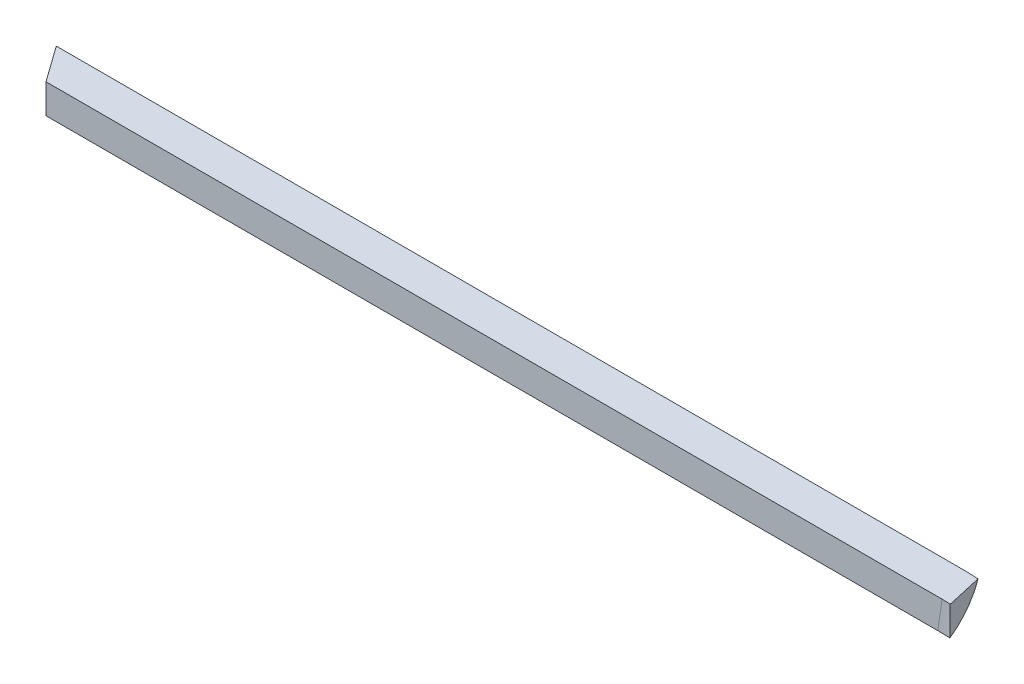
ISO-10303-21;
HEADER;
FILE_DESCRIPTION(('STEP AP214'),'2;1');
FILE_NAME('part.step','',(''),(''),'','','');
FILE_SCHEMA(('AUTOMOTIVE_DESIGN { 1 0 10303 214 1 1 1 1 }'));
ENDSEC;
DATA;
#1=APPLICATION_CONTEXT('core data for automotive mechanical design processes');
#2=APPLICATION_PROTOCOL_DEFINITION('international standard','automotive_design',2000,#1);
#3=PRODUCT_CONTEXT('',#1,'mechanical');
#4=PRODUCT('Part','Part','',(#3));
#5=PRODUCT_RELATED_PRODUCT_CATEGORY('part','',(#4));
#6=PRODUCT_DEFINITION_FORMATION('','',#4);
#7=PRODUCT_DEFINITION_CONTEXT('part definition',#1,'design');
#8=PRODUCT_DEFINITION('design','',#6,#7);
#9=PRODUCT_DEFINITION_SHAPE('','',#8);
#10=(LENGTH_UNIT() NAMED_UNIT(*) SI_UNIT(.MILLI.,.METRE.));
#11=(NAMED_UNIT(*) PLANE_ANGLE_UNIT() SI_UNIT($,.RADIAN.));
#12=(NAMED_UNIT(*) SI_UNIT($,.STERADIAN.) SOLID_ANGLE_UNIT());
#13=UNCERTAINTY_MEASURE_WITH_UNIT(LENGTH_MEASURE(1.E-05),#10,'distance_accuracy_value','');
#14=(GEOMETRIC_REPRESENTATION_CONTEXT(3) GLOBAL_UNCERTAINTY_ASSIGNED_CONTEXT((#13)) GLOBAL_UNIT_ASSIGNED_CONTEXT((#10,
#11,#12)) REPRESENTATION_CONTEXT('',''));
#15=CARTESIAN_POINT('',(0.,0.,0.));
#16=DIRECTION('',(0.,0.,1.));
#17=DIRECTION('',(1.,0.,0.));
#18=AXIS2_PLACEMENT_3D('',#15,#16,#17);
#19=CARTESIAN_POINT('',(86.5,0.,0.));
#20=DIRECTION('',(1.,0.,0.));
#21=DIRECTION('',(0.,0.,-1.));
#22=AXIS2_PLACEMENT_3D('',#19,#20,#21);
#23=PLANE('',#22);
#24=CARTESIAN_POINT('',(86.5,0.,0.));
#25=DIRECTION('',(1.,0.,0.));
#26=DIRECTION('',(0.,0.,-1.));
#27=AXIS2_PLACEMENT_3D('',#24,#25,#26);
#28=CIRCLE('',#27,85.);
#29=CARTESIAN_POINT('',(86.5,-81.8326014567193,-22.9875039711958));
#30=VERTEX_POINT('',#29);
#31=CARTESIAN_POINT('',(86.5,-81.4007699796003,-24.4727327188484));
#32=VERTEX_POINT('',#31);
#33=EDGE_CURVE('E135',#30,#32,#28,.T.);
#34=ORIENTED_EDGE('',*,*,#33,.F.);
#35=CARTESIAN_POINT('',(86.5,-83.3876780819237,-22.9717151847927));
#36=CARTESIAN_POINT('',(86.5,-83.258092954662,-22.9734548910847));
#37=CARTESIAN_POINT('',(86.5,-83.1285062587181,-22.9750749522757));
#38=CARTESIAN_POINT('',(86.5,-82.8693306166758,-22.9780964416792));
#39=CARTESIAN_POINT('',(86.5,-82.7397416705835,-22.9794978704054));
#40=CARTESIAN_POINT('',(86.5,-82.4805618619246,-22.9821027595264));
#41=CARTESIAN_POINT('',(86.5,-82.3509709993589,-22.9833062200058));
#42=CARTESIAN_POINT('',(86.5,-82.091787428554,-22.9855343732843));
#43=CARTESIAN_POINT('',(86.5,-81.9621947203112,-22.9865590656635));
#44=CARTESIAN_POINT('',(86.5,-81.8326014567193,-22.9875039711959));
#45=B_SPLINE_CURVE_WITH_KNOTS('',3,(#35,#36,#37,#38,#39,#40,#41,#42,#43,#44),.UNSPECIFIED.,.F.,
.F.,(4,2,2,2,4),(0.,0.388790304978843,0.777579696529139,1.16636892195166,1.55515906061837),.UNSPECIFIED.);
#46=CARTESIAN_POINT('',(86.5,-83.3876780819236,-22.9717151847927));
#47=VERTEX_POINT('',#46);
#48=EDGE_CURVE('E149',#47,#30,#45,.T.);
#49=ORIENTED_EDGE('',*,*,#48,.F.);
#50=CARTESIAN_POINT('',(86.5,-83.3876780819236,-22.9717151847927));
#51=CARTESIAN_POINT('',(86.5,-83.3249888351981,-23.0623396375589));
#52=CARTESIAN_POINT('',(86.5,-83.2585143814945,-23.1503434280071));
#53=CARTESIAN_POINT('',(86.5,-83.1185265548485,-23.3204927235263));
#54=CARTESIAN_POINT('',(86.5,-83.0450165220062,-23.4026409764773));
#55=CARTESIAN_POINT('',(86.5,-82.8914248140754,-23.5605531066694));
#56=CARTESIAN_POINT('',(86.5,-82.8113427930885,-23.636316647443));
#57=CARTESIAN_POINT('',(86.5,-82.6451329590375,-23.7809619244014));
#58=CARTESIAN_POINT('',(86.4999999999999,-82.5590029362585,-23.8498411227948));
#59=CARTESIAN_POINT('',(86.4999999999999,-82.3889494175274,-23.9746110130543));
#60=CARTESIAN_POINT('',(86.5,-82.3054705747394,-24.0311090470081));
#61=CARTESIAN_POINT('',(86.5,-82.1344324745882,-24.1376230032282));
#62=CARTESIAN_POINT('',(86.5,-82.0468718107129,-24.187636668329));
#63=CARTESIAN_POINT('',(86.5,-81.8679404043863,-24.2810031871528));
#64=CARTESIAN_POINT('',(86.5,-81.7765591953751,-24.3243359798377));
#65=CARTESIAN_POINT('',(86.5,-81.5907908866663,-24.4039086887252));
#66=CARTESIAN_POINT('',(86.5,-81.4964046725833,-24.4401506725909));
#67=CARTESIAN_POINT('',(86.5,-81.4007699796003,-24.4727327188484));
#68=B_SPLINE_CURVE_WITH_KNOTS('',3,(#50,#51,#52,#53,#54,#55,#56,#57,#58,#59,#60,#61,#62,#63,#64,
#65,#66,#67),.UNSPECIFIED.,.F.,.F.,(4,2,2,2,2,2,2,2,4),(0.,0.330484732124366,0.660813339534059,
0.991159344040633,1.32162667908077,1.62374215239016,1.9259625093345,2.22907339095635,
2.5320957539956),.UNSPECIFIED.);
#69=EDGE_CURVE('E171',#47,#32,#68,.T.);
#70=ORIENTED_EDGE('',*,*,#69,.T.);
#71=EDGE_LOOP('',(#34,#49,#70));
#72=FACE_BOUND('',#71,.T.);
#73=ADVANCED_FACE('F86',(#72),#23,.T.);
#74=CARTESIAN_POINT('',(38.0952752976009,-83.4050358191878,-23.));
#75=CARTESIAN_POINT('',(38.0952752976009,-83.2299307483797,-23.));
#76=CARTESIAN_POINT('',(38.0952752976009,-82.9672731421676,-23.));
#77=CARTESIAN_POINT('',(38.0952752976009,-82.6170630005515,-23.));
#78=CARTESIAN_POINT('',(38.0952752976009,-82.2668528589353,-23.));
#79=CARTESIAN_POINT('',(38.0952752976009,-82.0041952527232,-23.));
#80=CARTESIAN_POINT('',(38.0952752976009,-81.8290901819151,-23.));
#81=CARTESIAN_POINT('',(37.8896109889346,-83.1671640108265,-23.3258381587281));
#82=CARTESIAN_POINT('',(37.9073418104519,-83.0289051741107,-23.2989455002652));
#83=CARTESIAN_POINT('',(37.9336801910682,-82.8214411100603,-23.2584172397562));
#84=CARTESIAN_POINT('',(37.9682817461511,-82.5446652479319,-23.2039990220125));
#85=CARTESIAN_POINT('',(38.0025389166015,-82.2677828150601,-23.1493264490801));
#86=CARTESIAN_POINT('',(38.0278439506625,-82.0599990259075,-23.1080349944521));
#87=CARTESIAN_POINT('',(38.0445412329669,-81.9214204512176,-23.0803790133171));
#88=CARTESIAN_POINT('',(37.7041022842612,-82.8742570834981,-23.6197433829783));
#89=CARTESIAN_POINT('',(37.7398277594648,-82.7733927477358,-23.5655579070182));
#90=CARTESIAN_POINT('',(37.792896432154,-82.621943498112,-23.4838983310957));
#91=CARTESIAN_POINT('',(37.8626144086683,-82.419694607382,-23.3742521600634));
#92=CARTESIAN_POINT('',(37.9316384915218,-82.2172309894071,-23.2640934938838));
#93=CARTESIAN_POINT('',(37.9826250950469,-82.0651375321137,-23.1808961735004));
#94=CARTESIAN_POINT('',(38.0162681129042,-81.9636289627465,-23.1251726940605));
#95=CARTESIAN_POINT('',(37.5433395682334,-82.5316242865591,-23.8744430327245));
#96=CARTESIAN_POINT('',(37.5973294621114,-82.4687150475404,-23.7925555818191));
#97=CARTESIAN_POINT('',(37.6775291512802,-82.3741203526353,-23.6691480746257));
#98=CARTESIAN_POINT('',(37.7828899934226,-82.2475156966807,-23.50344600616));
#99=CARTESIAN_POINT('',(37.8872021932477,-82.1205865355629,-23.3369694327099));
#100=CARTESIAN_POINT('',(37.9642553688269,-82.0250182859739,-23.2112380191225));
#101=CARTESIAN_POINT('',(38.0150981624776,-81.9611354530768,-23.1270262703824));
#102=(BOUNDED_SURFACE() B_SPLINE_SURFACE(3,3,((#74,#75,#76,#77,#78,#79,#80),(#81,#82,#83,#84,
#85,#86,#87),(#88,#89,#90,#91,#92,#93,#94),(#95,#96,#97,#98,#99,#100,#101)),.UNSPECIFIED.,.F.,
.F.,.F.) B_SPLINE_SURFACE_WITH_KNOTS((4,4),(4,1,1,1,4),(0.,0.5),(0.,0.333333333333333,0.5,
0.666666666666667,1.),
.UNSPECIFIED.) GEOMETRIC_REPRESENTATION_ITEM() RATIONAL_B_SPLINE_SURFACE(((1.,1.,1.,1.,1.,1.,
1.),(0.985445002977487,0.985445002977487,0.985445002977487,0.985445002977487,0.985445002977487,
0.985445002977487,0.985445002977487),(0.97816750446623,0.97816750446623,0.97816750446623,
0.97816750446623,0.97816750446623,0.97816750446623,0.97816750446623),(0.97816750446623,
0.97816750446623,0.97816750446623,0.97816750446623,0.97816750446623,0.97816750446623,0.97816750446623))) REPRESENTATION_ITEM('') SURFACE());
#103=CARTESIAN_POINT('',(39.3795276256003,-79.5075707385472,-20.9653328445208));
#104=DIRECTION('',(0.845639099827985,0.,-0.533755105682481));
#105=DIRECTION('',(-0.533755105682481,0.,-0.845639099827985));
#106=AXIS2_PLACEMENT_3D('',#103,#104,#105);
#107=CIRCLE('',#106,4.58032843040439);
#108=CARTESIAN_POINT('',(38.0952752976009,-83.4050358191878,-23.));
#109=VERTEX_POINT('',#108);
#110=CARTESIAN_POINT('',(37.5433395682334,-82.531624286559,-23.8744430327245));
#111=VERTEX_POINT('',#110);
#112=EDGE_CURVE('E105',#109,#111,#107,.T.);
#113=DIRECTION('',(0.,1.,0.));
#114=VECTOR('',#113,1.);
#115=CARTESIAN_POINT('',(38.0952752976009,-75.,-23.));
#116=LINE('',#115,#114);
#117=CARTESIAN_POINT('',(38.0952752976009,-81.8290901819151,-23.));
#118=VERTEX_POINT('',#117);
#119=EDGE_CURVE('E142',#109,#118,#116,.T.);
#120=CARTESIAN_POINT('',(38.0150981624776,-81.9611354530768,-23.1270262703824));
#121=CARTESIAN_POINT('',(38.0139282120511,-81.9586419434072,-23.1288798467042));
#122=CARTESIAN_POINT('',(38.0398959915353,-81.9115200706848,-23.0877385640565));
#123=CARTESIAN_POINT('',(38.0952752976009,-81.8290901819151,-23.));
#124=CARTESIAN_POINT('',(38.0958210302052,-81.8282778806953,-22.9991353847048));
#125=CARTESIAN_POINT('',(38.0963667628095,-81.8274655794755,-22.9982707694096));
#126=CARTESIAN_POINT('',(38.0969124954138,-81.8266532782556,-22.9974061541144));
#127=(BOUNDED_CURVE() B_SPLINE_CURVE(3,(#120,#121,#122,#123,#124,#125,#126),.UNSPECIFIED.,.F.,
.F.) B_SPLINE_CURVE_WITH_KNOTS((4,3,4),(0.5,1.,1.005),
.UNSPECIFIED.) CURVE() GEOMETRIC_REPRESENTATION_ITEM() RATIONAL_B_SPLINE_CURVE((0.97816750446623,
0.97816750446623,0.985445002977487,1.,1.,1.,1.)) REPRESENTATION_ITEM(''));
#128=CARTESIAN_POINT('',(38.0150981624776,-81.9611354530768,-23.1270262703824));
#129=VERTEX_POINT('',#128);
#130=EDGE_CURVE('E271',#129,#118,#127,.T.);
#131=CARTESIAN_POINT('',(37.5433395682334,-82.5316242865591,-23.8744430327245));
#132=CARTESIAN_POINT('',(37.5973294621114,-82.4687150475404,-23.7925555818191));
#133=CARTESIAN_POINT('',(37.6775291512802,-82.3741203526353,-23.6691480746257));
#134=CARTESIAN_POINT('',(37.7828899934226,-82.2475156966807,-23.50344600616));
#135=CARTESIAN_POINT('',(37.8872021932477,-82.1205865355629,-23.3369694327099));
#136=CARTESIAN_POINT('',(37.9642553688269,-82.0250182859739,-23.2112380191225));
#137=CARTESIAN_POINT('',(38.0150981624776,-81.9611354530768,-23.1270262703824));
#138=(BOUNDED_CURVE() B_SPLINE_CURVE(3,(#131,#132,#133,#134,#135,#136,#137),.UNSPECIFIED.,.F.,
.F.) B_SPLINE_CURVE_WITH_KNOTS((4,1,1,1,4),(0.,0.333333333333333,0.5,0.666666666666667,1.),
.UNSPECIFIED.) CURVE() GEOMETRIC_REPRESENTATION_ITEM() RATIONAL_B_SPLINE_CURVE((0.97816750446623,
0.97816750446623,0.97816750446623,0.97816750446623,0.97816750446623,0.97816750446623,0.97816750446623)) REPRESENTATION_ITEM(''));
#139=EDGE_CURVE('E158',#111,#129,#138,.T.);
#140=ORIENTED_EDGE('',*,*,#112,.F.);
#141=ORIENTED_EDGE('',*,*,#119,.T.);
#142=ORIENTED_EDGE('',*,*,#130,.F.);
#143=ORIENTED_EDGE('',*,*,#139,.F.);
#144=EDGE_LOOP('',(#140,#141,#142,#143));
#145=FACE_BOUND('',#144,.T.);
#146=ADVANCED_FACE('F156',(#145),#102,.F.);
#147=CARTESIAN_POINT('',(37.5433395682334,-82.5316242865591,-23.8744430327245));
#148=CARTESIAN_POINT('',(37.5973294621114,-82.4687150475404,-23.7925555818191));
#149=CARTESIAN_POINT('',(37.6775291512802,-82.3741203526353,-23.6691480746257));
#150=CARTESIAN_POINT('',(37.7828899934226,-82.2475156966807,-23.50344600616));
#151=CARTESIAN_POINT('',(37.8872021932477,-82.1205865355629,-23.3369694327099));
#152=CARTESIAN_POINT('',(37.9642553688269,-82.0250182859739,-23.2112380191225));
#153=CARTESIAN_POINT('',(38.0150981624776,-81.9611354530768,-23.1270262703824));
#154=CARTESIAN_POINT('',(37.3825768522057,-82.18899148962,-24.1291426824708));
#155=CARTESIAN_POINT('',(37.4548311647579,-82.164037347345,-24.0195532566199));
#156=CARTESIAN_POINT('',(37.5621618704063,-82.1262972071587,-23.8543978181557));
#157=CARTESIAN_POINT('',(37.7031655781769,-82.0753367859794,-23.6326398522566));
#158=CARTESIAN_POINT('',(37.8427658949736,-82.0239420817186,-23.4098453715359));
#159=CARTESIAN_POINT('',(37.945885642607,-81.9848990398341,-23.2415798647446));
#160=CARTESIAN_POINT('',(38.0139282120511,-81.9586419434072,-23.1288798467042));
#161=CARTESIAN_POINT('',(37.2513090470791,-81.8067541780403,-24.3371129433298));
#162=CARTESIAN_POINT('',(37.3415580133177,-81.8191945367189,-24.2002306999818));
#163=CARTESIAN_POINT('',(37.4756190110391,-81.8374692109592,-23.993943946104));
#164=CARTESIAN_POINT('',(37.651739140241,-81.8610357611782,-23.7169580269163));
#165=CARTESIAN_POINT('',(37.8261063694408,-81.8840598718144,-23.4386774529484));
#166=CARTESIAN_POINT('',(37.9549076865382,-81.900707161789,-23.2285060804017));
#167=CARTESIAN_POINT('',(38.0398959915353,-81.9115200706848,-23.0877385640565));
#168=CARTESIAN_POINT('',(37.1517581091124,-81.3941222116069,-24.4948335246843));
#169=CARTESIAN_POINT('',(37.2597378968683,-81.4434088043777,-24.3310586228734));
#170=CARTESIAN_POINT('',(37.420137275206,-81.5168770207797,-24.0842436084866));
#171=CARTESIAN_POINT('',(37.6308589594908,-81.6138778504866,-23.7528394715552));
#172=CARTESIAN_POINT('',(37.839483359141,-81.7102296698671,-23.4198863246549));
#173=CARTESIAN_POINT('',(37.9935897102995,-81.7817507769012,-23.1684234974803));
#174=CARTESIAN_POINT('',(38.0952752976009,-81.8290901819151,-23.));
#175=CARTESIAN_POINT('',(37.1507770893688,-81.390055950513,-24.4963877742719));
#176=CARTESIAN_POINT('',(37.2589316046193,-81.4397056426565,-24.332347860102));
#177=CARTESIAN_POINT('',(37.4195905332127,-81.5137177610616,-24.0851334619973));
#178=CARTESIAN_POINT('',(37.630653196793,-81.6114422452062,-23.7531930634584));
#179=CARTESIAN_POINT('',(37.8396151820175,-81.7085166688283,-23.4197011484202));
#180=CARTESIAN_POINT('',(37.9939709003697,-81.7805785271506,-23.1678314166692));
#181=CARTESIAN_POINT('',(38.0958210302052,-81.8282778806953,-22.9991353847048));
#182=CARTESIAN_POINT('',(37.1497960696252,-81.3859896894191,-24.4979420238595));
#183=CARTESIAN_POINT('',(37.2581253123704,-81.4360024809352,-24.3336370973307));
#184=CARTESIAN_POINT('',(37.4190437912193,-81.5105585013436,-24.086023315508));
#185=CARTESIAN_POINT('',(37.6304474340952,-81.6090066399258,-23.7535466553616));
#186=CARTESIAN_POINT('',(37.8397470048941,-81.7068036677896,-23.4195159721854));
#187=CARTESIAN_POINT('',(37.9943520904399,-81.7794062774,-23.1672393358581));
#188=CARTESIAN_POINT('',(38.0963667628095,-81.8274655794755,-22.9982707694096));
#189=CARTESIAN_POINT('',(37.1488150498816,-81.3819234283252,-24.4994962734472));
#190=CARTESIAN_POINT('',(37.2573190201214,-81.432299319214,-24.3349263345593));
#191=CARTESIAN_POINT('',(37.418497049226,-81.5073992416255,-24.0869131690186));
#192=CARTESIAN_POINT('',(37.6302416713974,-81.6065710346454,-23.7539002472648));
#193=CARTESIAN_POINT('',(37.8398788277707,-81.7050906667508,-23.4193307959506));
#194=CARTESIAN_POINT('',(37.9947332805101,-81.7782340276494,-23.1666472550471));
#195=CARTESIAN_POINT('',(38.0969124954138,-81.8266532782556,-22.9974061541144));
#196=(BOUNDED_SURFACE() B_SPLINE_SURFACE(3,3,((#147,#148,#149,#150,#151,#152,#153),(#154,#155,
#156,#157,#158,#159,#160),(#161,#162,#163,#164,#165,#166,#167),(#168,#169,#170,#171,#172,#173,
#174),(#175,#176,#177,#178,#179,#180,#181),(#182,#183,#184,#185,#186,#187,#188),(#189,#190,#191,
#192,#193,#194,#195)),.UNSPECIFIED.,.F.,.F.,.F.) B_SPLINE_SURFACE_WITH_KNOTS((4,3,4),(4,1,1,1,
4),(0.5,1.,1.005),(0.,0.333333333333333,0.5,0.666666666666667,1.),
.UNSPECIFIED.) GEOMETRIC_REPRESENTATION_ITEM() RATIONAL_B_SPLINE_SURFACE(((0.97816750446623,
0.97816750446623,0.97816750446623,0.97816750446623,0.97816750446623,0.97816750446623,
0.97816750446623),(0.97816750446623,0.97816750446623,0.97816750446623,0.97816750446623,
0.97816750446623,0.97816750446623,0.97816750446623),(0.985445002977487,0.985445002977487,
0.985445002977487,0.985445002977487,0.985445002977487,0.985445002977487,0.985445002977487),(1.,
1.,1.,1.,1.,1.,1.),(1.,1.,1.,1.,1.,1.,1.),(1.,1.,1.,1.,1.,1.,1.),(1.,1.,1.,1.,1.,1.,1.))) REPRESENTATION_ITEM('') SURFACE());
#197=CARTESIAN_POINT('',(39.3795276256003,-79.5075707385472,-20.9653328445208));
#198=DIRECTION('',(0.845639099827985,0.,-0.533755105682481));
#199=DIRECTION('',(-0.533755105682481,0.,-0.845639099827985));
#200=AXIS2_PLACEMENT_3D('',#197,#198,#199);
#201=CIRCLE('',#200,4.58032843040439);
#202=CARTESIAN_POINT('',(37.1517581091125,-81.394122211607,-24.4948335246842));
#203=VERTEX_POINT('',#202);
#204=EDGE_CURVE('E161',#111,#203,#201,.T.);
#205=CARTESIAN_POINT('',(38.0952752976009,-81.8290901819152,-23.));
#206=CARTESIAN_POINT('',(37.9806490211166,-81.7757263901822,-23.1898574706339));
#207=CARTESIAN_POINT('',(37.8646594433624,-81.7219163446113,-23.3787651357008));
#208=CARTESIAN_POINT('',(37.6499158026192,-81.6226603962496,-23.7227248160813));
#209=CARTESIAN_POINT('',(37.5515809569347,-81.5773464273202,-23.8780767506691));
#210=CARTESIAN_POINT('',(37.3530544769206,-81.486151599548,-24.1874577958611));
#211=CARTESIAN_POINT('',(37.2528625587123,-81.4402706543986,-24.341486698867));
#212=CARTESIAN_POINT('',(37.1517581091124,-81.3941222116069,-24.4948335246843));
#213=B_SPLINE_CURVE_WITH_KNOTS('',3,(#205,#206,#207,#208,#209,#210,#211,#212),.UNSPECIFIED.,.F.,
.F.,(4,2,2,4),(0.,0.684311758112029,1.25237823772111,1.82053228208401),.UNSPECIFIED.);
#214=EDGE_CURVE('E178',#118,#203,#213,.T.);
#215=ORIENTED_EDGE('',*,*,#204,.F.);
#216=ORIENTED_EDGE('',*,*,#139,.T.);
#217=ORIENTED_EDGE('',*,*,#130,.T.);
#218=ORIENTED_EDGE('',*,*,#214,.T.);
#219=EDGE_LOOP('',(#215,#216,#217,#218));
#220=FACE_BOUND('',#219,.T.);
#221=ADVANCED_FACE('F238',(#220),#196,.F.);
#222=CARTESIAN_POINT('',(34.5,-75.,-23.));
#223=DIRECTION('',(0.,0.,1.));
#224=DIRECTION('',(1.,0.,0.));
#225=AXIS2_PLACEMENT_3D('',#222,#223,#224);
#226=PLANE('',#225);
#227=CARTESIAN_POINT('',(34.5,-75.,-23.));
#228=DIRECTION('',(0.,0.,1.));
#229=DIRECTION('',(1.,0.,0.));
#230=AXIS2_PLACEMENT_3D('',#227,#228,#229);
#231=CIRCLE('',#230,52.);
#232=CARTESIAN_POINT('',(86.0496219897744,-81.8290901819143,-23.));
#233=VERTEX_POINT('',#232);
#234=CARTESIAN_POINT('',(85.8162291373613,-83.4050358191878,-23.));
#235=VERTEX_POINT('',#234);
#236=EDGE_CURVE('E150',#233,#235,#231,.F.);
#237=ORIENTED_EDGE('',*,*,#236,.F.);
#238=DIRECTION('',(1.,0.,0.));
#239=VECTOR('',#238,1.);
#240=CARTESIAN_POINT('',(-25.5,-81.8290901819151,-23.));
#241=LINE('',#240,#239);
#242=EDGE_CURVE('E147',#118,#233,#241,.T.);
#243=ORIENTED_EDGE('',*,*,#242,.F.);
#244=ORIENTED_EDGE('',*,*,#119,.F.);
#245=DIRECTION('',(1.,0.,0.));
#246=VECTOR('',#245,1.);
#247=CARTESIAN_POINT('',(34.5,-83.4050358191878,-23.));
#248=LINE('',#247,#246);
#249=EDGE_CURVE('E145',#235,#109,#248,.F.);
#250=ORIENTED_EDGE('',*,*,#249,.F.);
#251=EDGE_LOOP('',(#237,#243,#244,#250));
#252=FACE_BOUND('',#251,.T.);
#253=ADVANCED_FACE('F144',(#252),#226,.T.);
#254=CARTESIAN_POINT('',(34.5,-75.,-15.));
#255=DIRECTION('',(0.,0.,1.));
#256=DIRECTION('',(1.,0.,0.));
#257=AXIS2_PLACEMENT_3D('',#254,#255,#256);
#258=TOROIDAL_SURFACE('',#257,52.,8.);
#259=ORIENTED_EDGE('',*,*,#48,.T.);
#260=CARTESIAN_POINT('',(86.5002,-81.832604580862,-22.9874928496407));
#261=CARTESIAN_POINT('',(86.2728742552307,-81.8290366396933,-23.0001669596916));
#262=CARTESIAN_POINT('',(86.0449935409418,-81.8281936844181,-23.0031830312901));
#263=CARTESIAN_POINT('',(85.5898872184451,-81.8318461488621,-22.9902008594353));
#264=CARTESIAN_POINT('',(85.3626614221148,-81.8363398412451,-22.9742087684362));
#265=CARTESIAN_POINT('',(84.9111550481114,-81.8505306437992,-22.923595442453));
#266=CARTESIAN_POINT('',(84.686867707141,-81.8602121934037,-22.8890299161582));
#267=CARTESIAN_POINT('',(84.2421112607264,-81.8845546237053,-22.801793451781));
#268=CARTESIAN_POINT('',(84.0216423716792,-81.8992157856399,-22.7491214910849));
#269=CARTESIAN_POINT('',(83.5862508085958,-81.9332215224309,-22.6263397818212));
#270=CARTESIAN_POINT('',(83.3713224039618,-81.9525610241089,-22.5562489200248));
#271=CARTESIAN_POINT('',(82.9480591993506,-81.9956040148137,-22.3992755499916));
#272=CARTESIAN_POINT('',(82.7397268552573,-82.019309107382,-22.3123868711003));
#273=CARTESIAN_POINT('',(82.3309512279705,-82.0707083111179,-22.1225789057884));
#274=CARTESIAN_POINT('',(82.1305094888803,-82.0984031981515,-22.0196565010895));
#275=CARTESIAN_POINT('',(81.7386983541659,-82.1573685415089,-21.7986210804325));
#276=CARTESIAN_POINT('',(81.5473324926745,-82.1886403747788,-21.680502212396));
#277=CARTESIAN_POINT('',(80.9729457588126,-82.2899317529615,-21.2941298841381));
#278=CARTESIAN_POINT('',(80.6066968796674,-82.3652518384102,-21.0017657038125));
#279=CARTESIAN_POINT('',(79.9273579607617,-82.5255416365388,-20.3627870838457));
#280=CARTESIAN_POINT('',(79.614287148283,-82.6105148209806,-20.0161531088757));
#281=CARTESIAN_POINT('',(79.1847390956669,-82.7439324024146,-19.4545877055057));
#282=CARTESIAN_POINT('',(79.0458583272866,-82.7904066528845,-19.2559737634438));
#283=CARTESIAN_POINT('',(78.7857943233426,-82.8842986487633,-18.8477271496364));
#284=CARTESIAN_POINT('',(78.6646045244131,-82.9317160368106,-18.6380986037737));
#285=CARTESIAN_POINT('',(78.4409824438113,-83.0269348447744,-18.2092377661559));
#286=CARTESIAN_POINT('',(78.3385448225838,-83.0747361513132,-17.9900082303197));
#287=CARTESIAN_POINT('',(78.1534152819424,-83.1701864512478,-17.5434367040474));
#288=CARTESIAN_POINT('',(78.0707140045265,-83.2178355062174,-17.3160986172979));
#289=CARTESIAN_POINT('',(77.9338550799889,-83.3073156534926,-16.8800223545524));
#290=CARTESIAN_POINT('',(77.877566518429,-83.3492138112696,-16.6719643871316));
#291=CARTESIAN_POINT('',(77.7819687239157,-83.4321497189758,-16.251838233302));
#292=CARTESIAN_POINT('',(77.7426567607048,-83.4731876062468,-16.0397706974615));
#293=CARTESIAN_POINT('',(77.6814852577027,-83.5541550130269,-15.612509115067));
#294=CARTESIAN_POINT('',(77.6596574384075,-83.5940823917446,-15.397310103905));
#295=CARTESIAN_POINT('',(77.6339698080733,-83.6724728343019,-14.9654879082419));
#296=CARTESIAN_POINT('',(77.6301175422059,-83.7109352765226,-14.7488641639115));
#297=CARTESIAN_POINT('',(77.6354608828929,-83.7485090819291,-14.5322822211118));
#298=B_SPLINE_CURVE_WITH_KNOTS('',3,(#260,#261,#262,#263,#264,#265,#266,#267,#268,#269,#270,
#271,#272,#273,#274,#275,#276,#277,#278,#279,#280,#281,#282,#283,#284,#285,#286,#287,#288,#289,
#290,#291,#292,#293,#294,#295,#296,#297),.UNSPECIFIED.,.F.,.F.,(4,2,2,2,2,2,2,2,2,2,2,2,2,2,2,2,
2,2,4),(0.,0.682863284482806,1.36550560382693,2.04611175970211,2.72675636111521,
3.40666615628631,4.0868261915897,4.76711867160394,5.44767391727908,6.86491441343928,
8.28266624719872,9.02222900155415,9.76151667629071,10.5005935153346,11.2393192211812,
11.8973667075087,12.5553083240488,13.2144409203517,13.8738501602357),.UNSPECIFIED.);
#299=EDGE_CURVE('E220',#30,#233,#298,.T.);
#300=ORIENTED_EDGE('',*,*,#299,.T.);
#301=ORIENTED_EDGE('',*,*,#236,.T.);
#302=CARTESIAN_POINT('',(86.5,-83.3876780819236,-22.9717151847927));
#303=CARTESIAN_POINT('',(86.4208117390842,-83.3883996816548,-22.9782976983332));
#304=CARTESIAN_POINT('',(86.3415326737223,-83.3895727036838,-22.9837251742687));
#305=CARTESIAN_POINT('',(86.1879539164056,-83.3927145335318,-22.9920085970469));
#306=CARTESIAN_POINT('',(86.1136607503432,-83.3946275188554,-22.9950070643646));
#307=CARTESIAN_POINT('',(85.9649825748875,-83.3992410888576,-22.9990039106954));
#308=CARTESIAN_POINT('',(85.8905975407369,-83.4019423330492,-23.0000006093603));
#309=CARTESIAN_POINT('',(85.8162291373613,-83.4050358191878,-23.));
#310=B_SPLINE_CURVE_WITH_KNOTS('',3,(#302,#303,#304,#305,#306,#307,#308,#309),.UNSPECIFIED.,.F.,
.F.,(4,2,2,4),(0.,0.238382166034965,0.461485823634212,0.684776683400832),.UNSPECIFIED.);
#311=EDGE_CURVE('E154',#47,#235,#310,.T.);
#312=ORIENTED_EDGE('',*,*,#311,.F.);
#313=EDGE_LOOP('',(#259,#300,#301,#312));
#314=FACE_BOUND('',#313,.T.);
#315=ADVANCED_FACE('F210',(#314),#258,.F.);
#316=CARTESIAN_POINT('',(-78.5,0.,0.));
#317=DIRECTION('',(1.,0.,0.));
#318=DIRECTION('',(0.,0.,-1.));
#319=AXIS2_PLACEMENT_3D('',#316,#317,#318);
#320=CYLINDRICAL_SURFACE('',#319,85.);
#321=ORIENTED_EDGE('',*,*,#214,.F.);
#322=ORIENTED_EDGE('',*,*,#242,.T.);
#323=ORIENTED_EDGE('',*,*,#299,.F.);
#324=ORIENTED_EDGE('',*,*,#33,.T.);
#325=CARTESIAN_POINT('',(86.5,-81.4007699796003,-24.4727327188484));
#326=CARTESIAN_POINT('',(86.4603343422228,-81.4001548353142,-24.4747788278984));
#327=CARTESIAN_POINT('',(86.4206681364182,-81.3995391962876,-24.476826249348));
#328=CARTESIAN_POINT('',(86.3413239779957,-81.3983511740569,-24.48077674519));
#329=CARTESIAN_POINT('',(86.3016460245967,-81.3977787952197,-24.4826798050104));
#330=CARTESIAN_POINT('',(86.2248508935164,-81.3967559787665,-24.4860801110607));
#331=CARTESIAN_POINT('',(86.1877346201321,-81.3963000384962,-24.487595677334));
#332=CARTESIAN_POINT('',(86.1134893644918,-81.3954964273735,-24.4902667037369));
#333=CARTESIAN_POINT('',(86.0763603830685,-81.3951487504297,-24.4914221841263));
#334=CARTESIAN_POINT('',(86.002069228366,-81.394610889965,-24.4932096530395));
#335=CARTESIAN_POINT('',(85.9649070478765,-81.3944207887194,-24.4938413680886));
#336=CARTESIAN_POINT('',(85.8905724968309,-81.3941757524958,-24.4946556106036));
#337=CARTESIAN_POINT('',(85.8534001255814,-81.3941208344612,-24.4948380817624));
#338=CARTESIAN_POINT('',(85.8162291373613,-81.3941222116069,-24.4948335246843));
#339=B_SPLINE_CURVE_WITH_KNOTS('',3,(#325,#326,#327,#328,#329,#330,#331,#332,#333,#334,#335,
#336,#337,#338),.UNSPECIFIED.,.F.,.F.,(4,2,2,2,2,2,4),(0.,0.119170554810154,0.238353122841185,
0.349801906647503,0.4612444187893,0.572745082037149,0.684259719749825),.UNSPECIFIED.);
#340=CARTESIAN_POINT('',(85.8162291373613,-81.3941222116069,-24.4948335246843));
#341=VERTEX_POINT('',#340);
#342=EDGE_CURVE('E96',#32,#341,#339,.T.);
#343=ORIENTED_EDGE('',*,*,#342,.T.);
#344=DIRECTION('',(1.,0.,0.));
#345=VECTOR('',#344,1.);
#346=CARTESIAN_POINT('',(-78.5,-81.3941222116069,-24.4948335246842));
#347=LINE('',#346,#345);
#348=EDGE_CURVE('E12',#341,#203,#347,.F.);
#349=ORIENTED_EDGE('',*,*,#348,.T.);
#350=EDGE_LOOP('',(#321,#322,#323,#324,#343,#349));
#351=FACE_BOUND('',#350,.T.);
#352=ADVANCED_FACE('F186',(#351),#320,.F.);
#353=CARTESIAN_POINT('',(86.5,-83.3876780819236,-22.9717151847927));
#354=CARTESIAN_POINT('',(86.4747265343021,-83.3879351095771,-22.9737474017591));
#355=CARTESIAN_POINT('',(86.4241796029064,-83.388449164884,-22.9778118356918));
#356=CARTESIAN_POINT('',(86.3482784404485,-83.3895699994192,-22.9830158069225));
#357=CARTESIAN_POINT('',(86.2723323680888,-83.3909463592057,-22.9875676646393));
#358=CARTESIAN_POINT('',(86.1963459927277,-83.3926029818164,-22.9914043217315));
#359=CARTESIAN_POINT('',(86.1203322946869,-83.3945327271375,-22.994544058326));
#360=CARTESIAN_POINT('',(86.0493706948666,-83.3965900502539,-22.9968207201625));
#361=CARTESIAN_POINT('',(85.9936116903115,-83.3983871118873,-22.9981487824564));
#362=CARTESIAN_POINT('',(85.9530608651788,-83.3997815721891,-22.9988914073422));
#363=CARTESIAN_POINT('',(85.9201147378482,-83.4009619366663,-22.9993739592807));
#364=CARTESIAN_POINT('',(85.8897052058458,-83.4021006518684,-22.9996940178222));
#365=CARTESIAN_POINT('',(85.8656333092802,-83.403036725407,-22.9998591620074));
#366=CARTESIAN_POINT('',(85.8504309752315,-83.403640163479,-22.9999322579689));
#367=CARTESIAN_POINT('',(85.8390297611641,-83.4040989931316,-22.9999711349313));
#368=CARTESIAN_POINT('',(85.8276290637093,-83.4045635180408,-22.9999954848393));
#369=CARTESIAN_POINT('',(85.8200291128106,-83.4048783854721,-22.9999984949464));
#370=CARTESIAN_POINT('',(85.8162291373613,-83.4050358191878,-23.));
#371=CARTESIAN_POINT('',(86.4999999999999,-82.8990033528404,-23.6779938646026));
#372=CARTESIAN_POINT('',(86.4754982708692,-82.898558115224,-23.6799040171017));
#373=CARTESIAN_POINT('',(86.4265171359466,-82.8976676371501,-23.683724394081));
#374=CARTESIAN_POINT('',(86.3524078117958,-82.8966314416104,-23.688755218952));
#375=CARTESIAN_POINT('',(86.2769892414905,-82.8958983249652,-23.6931417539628));
#376=CARTESIAN_POINT('',(86.1994339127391,-82.8955511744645,-23.6967366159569));
#377=CARTESIAN_POINT('',(86.1188476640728,-82.8956516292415,-23.6994463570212));
#378=CARTESIAN_POINT('',(86.0399907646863,-82.8962259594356,-23.7010484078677));
#379=CARTESIAN_POINT('',(85.9749647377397,-82.8970604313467,-23.7015827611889));
#380=CARTESIAN_POINT('',(85.9260694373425,-82.8978699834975,-23.7015933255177));
#381=CARTESIAN_POINT('',(85.8854732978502,-82.8986421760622,-23.7013894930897));
#382=CARTESIAN_POINT('',(85.8473113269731,-82.8994719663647,-23.7009951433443));
#383=CARTESIAN_POINT('',(85.8160069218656,-82.9002155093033,-23.7005308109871));
#384=CARTESIAN_POINT('',(85.7963957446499,-82.9007165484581,-23.7001827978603));
#385=CARTESIAN_POINT('',(85.7819883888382,-82.9011083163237,-23.6998939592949));
#386=CARTESIAN_POINT('',(85.7668663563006,-82.9015157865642,-23.6995783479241));
#387=CARTESIAN_POINT('',(85.7565858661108,-82.901799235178,-23.699346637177));
#388=CARTESIAN_POINT('',(85.7514309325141,-82.9019428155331,-23.6992284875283));
#389=CARTESIAN_POINT('',(86.4999999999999,-82.2137172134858,-24.195695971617));
#390=CARTESIAN_POINT('',(86.4756075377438,-82.2130296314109,-24.1973703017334));
#391=CARTESIAN_POINT('',(86.4268450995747,-82.2116544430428,-24.2007190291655));
#392=CARTESIAN_POINT('',(86.3530620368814,-82.2097915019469,-24.2052987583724));
#393=CARTESIAN_POINT('',(86.2779264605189,-82.2081803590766,-24.2093692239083));
#394=CARTESIAN_POINT('',(86.2005789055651,-82.2069127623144,-24.2127629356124));
#395=CARTESIAN_POINT('',(86.1200895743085,-82.2060699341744,-24.2153392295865));
#396=CARTESIAN_POINT('',(86.0411884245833,-82.2057582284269,-24.2168426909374));
#397=CARTESIAN_POINT('',(85.9760074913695,-82.2059041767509,-24.2172902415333));
#398=CARTESIAN_POINT('',(85.9269381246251,-82.2062211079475,-24.2172227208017));
#399=CARTESIAN_POINT('',(85.8861510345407,-82.2065987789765,-24.216944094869));
#400=CARTESIAN_POINT('',(85.8479848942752,-82.2070650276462,-24.216487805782));
#401=CARTESIAN_POINT('',(85.8161829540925,-82.2075224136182,-24.2159764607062));
#402=CARTESIAN_POINT('',(85.7966066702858,-82.2078433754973,-24.2155994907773));
#403=CARTESIAN_POINT('',(85.782614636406,-82.208100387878,-24.2152894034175));
#404=CARTESIAN_POINT('',(85.7672829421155,-82.2083735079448,-24.2149528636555));
#405=CARTESIAN_POINT('',(85.7567252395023,-82.2085674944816,-24.21470764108));
#406=CARTESIAN_POINT('',(85.7514309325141,-82.2086665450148,-24.2145826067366));
#407=CARTESIAN_POINT('',(86.5,-81.4007699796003,-24.4727327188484));
#408=CARTESIAN_POINT('',(86.4747239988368,-81.4003776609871,-24.4740371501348));
#409=CARTESIAN_POINT('',(86.4241719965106,-81.3995930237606,-24.4766460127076));
#410=CARTESIAN_POINT('',(86.3483284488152,-81.3984496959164,-24.4804474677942));
#411=CARTESIAN_POINT('',(86.2724537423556,-81.3973736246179,-24.4840252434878));
#412=CARTESIAN_POINT('',(86.1965325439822,-81.3963984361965,-24.4872675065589));
#413=CARTESIAN_POINT('',(86.1205484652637,-81.395557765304,-24.4900623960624));
#414=CARTESIAN_POINT('',(86.0495596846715,-81.394930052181,-24.4921491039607));
#415=CARTESIAN_POINT('',(85.9937151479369,-81.3945700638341,-24.4933456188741));
#416=CARTESIAN_POINT('',(85.9530792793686,-81.3943813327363,-24.4939727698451));
#417=CARTESIAN_POINT('',(85.9200067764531,-81.3942702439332,-24.494341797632));
#418=CARTESIAN_POINT('',(85.8900961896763,-81.3941942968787,-24.4945940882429));
#419=CARTESIAN_POINT('',(85.8650101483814,-81.394155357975,-24.4947234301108));
#420=CARTESIAN_POINT('',(85.8502411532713,-81.3941381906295,-24.4947804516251));
#421=CARTESIAN_POINT('',(85.8403457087,-81.3941290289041,-24.4948108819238));
#422=CARTESIAN_POINT('',(85.8285893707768,-81.3941232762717,-24.4948299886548));
#423=CARTESIAN_POINT('',(85.8203492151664,-81.3941225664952,-24.4948323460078));
#424=CARTESIAN_POINT('',(85.8162291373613,-81.3941222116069,-24.4948335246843));
#425=(BOUNDED_SURFACE() B_SPLINE_SURFACE(3,3,((#353,#354,#355,#356,#357,#358,#359,#360,#361,
#362,#363,#364,#365,#366,#367,#368,#369,#370),(#371,#372,#373,#374,#375,#376,#377,#378,#379,
#380,#381,#382,#383,#384,#385,#386,#387,#388),(#389,#390,#391,#392,#393,#394,#395,#396,#397,
#398,#399,#400,#401,#402,#403,#404,#405,#406),(#407,#408,#409,#410,#411,#412,#413,#414,#415,
#416,#417,#418,#419,#420,#421,#422,#423,#424)),.UNSPECIFIED.,.F.,.F.,
.F.) B_SPLINE_SURFACE_WITH_KNOTS((4,4),(4,1,1,1,1,1,1,1,1,1,1,1,1,1,1,4),(0.,1.),(0.,
0.0555555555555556,0.111111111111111,0.166666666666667,0.222222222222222,0.277777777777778,
0.333333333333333,0.377777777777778,0.4,0.422222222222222,0.45,0.466666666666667,0.475,
0.483333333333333,0.491666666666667,0.5),
.UNSPECIFIED.) GEOMETRIC_REPRESENTATION_ITEM() RATIONAL_B_SPLINE_SURFACE(((1.,1.,1.,1.,1.,1.,1.,
1.,1.,1.,1.,1.,1.,1.,1.,1.,1.,1.),(0.966461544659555,0.966461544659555,0.966444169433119,
0.966386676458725,0.966318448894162,0.966260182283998,0.966232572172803,0.966254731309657,
0.966319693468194,0.966395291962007,0.966473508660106,0.966564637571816,0.966651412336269,
0.966711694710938,0.966759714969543,0.966810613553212,0.966846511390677,0.966864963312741),
(0.966461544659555,0.966461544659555,0.966444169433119,0.966386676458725,0.966318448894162,
0.966260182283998,0.966232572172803,0.966254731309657,0.966319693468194,0.966395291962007,
0.966473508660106,0.966564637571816,0.966651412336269,0.966711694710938,0.966759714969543,
0.966810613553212,0.966846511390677,0.966864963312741),(1.,1.,1.,1.,1.,1.,1.,1.,1.,1.,1.,1.,1.,
1.,1.,1.,1.,1.))) REPRESENTATION_ITEM('') SURFACE());
#426=CARTESIAN_POINT('',(86.7375269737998,-80.1854788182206,-20.7689150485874));
#427=DIRECTION('',(0.970542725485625,-0.143734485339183,-0.193357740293));
#428=DIRECTION('',(-0.195386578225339,0.,-0.980726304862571));
#429=AXIS2_PLACEMENT_3D('',#426,#427,#428);
#430=CIRCLE('',#429,4.0239380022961);
#431=EDGE_CURVE('E153',#235,#341,#430,.T.);
#432=ORIENTED_EDGE('',*,*,#69,.F.);
#433=ORIENTED_EDGE('',*,*,#311,.T.);
#434=ORIENTED_EDGE('',*,*,#431,.T.);
#435=ORIENTED_EDGE('',*,*,#342,.F.);
#436=EDGE_LOOP('',(#432,#433,#434,#435));
#437=FACE_BOUND('',#436,.T.);
#438=ADVANCED_FACE('F180',(#437),#425,.F.);
#439=CARTESIAN_POINT('',(85.8162291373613,-83.4050358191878,-23.));
#440=CARTESIAN_POINT('',(85.6571592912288,-83.4050358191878,-23.));
#441=CARTESIAN_POINT('',(85.126926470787,-83.4050358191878,-23.));
#442=CARTESIAN_POINT('',(84.3315772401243,-83.4050358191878,-23.));
#443=CARTESIAN_POINT('',(83.4301814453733,-83.4050358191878,-23.));
#444=CARTESIAN_POINT('',(82.3697158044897,-83.4050358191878,-23.));
#445=CARTESIAN_POINT('',(80.7790173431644,-83.4050358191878,-23.));
#446=CARTESIAN_POINT('',(78.6580860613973,-83.4050358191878,-23.));
#447=CARTESIAN_POINT('',(76.3604105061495,-83.4050358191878,-23.));
#448=CARTESIAN_POINT('',(73.4441299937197,-83.4050358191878,-23.));
#449=CARTESIAN_POINT('',(69.5557559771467,-83.4050358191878,-23.));
#450=CARTESIAN_POINT('',(64.60691631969,-83.4050358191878,-23.));
#451=CARTESIAN_POINT('',(59.3045881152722,-83.4050358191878,-23.));
#452=CARTESIAN_POINT('',(54.0022599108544,-83.4050358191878,-23.));
#453=CARTESIAN_POINT('',(48.6999317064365,-83.4050358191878,-23.));
#454=CARTESIAN_POINT('',(43.3976035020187,-83.4050358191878,-23.));
#455=CARTESIAN_POINT('',(39.8627180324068,-83.4050358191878,-23.));
#456=CARTESIAN_POINT('',(38.0952752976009,-83.4050358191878,-23.));
#457=CARTESIAN_POINT('',(85.7514309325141,-82.9019428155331,-23.6992284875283));
#458=CARTESIAN_POINT('',(85.5907817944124,-82.9019660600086,-23.6991567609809));
#459=CARTESIAN_POINT('',(85.055272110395,-82.902045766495,-23.6989149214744));
#460=CARTESIAN_POINT('',(84.2496838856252,-82.902176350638,-23.6985385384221));
#461=CARTESIAN_POINT('',(83.3381897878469,-82.9023389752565,-23.6980938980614));
#462=CARTESIAN_POINT('',(82.265404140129,-82.90254437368,-23.6975534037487));
#463=CARTESIAN_POINT('',(80.6562348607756,-82.9028835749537,-23.6967042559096));
#464=CARTESIAN_POINT('',(78.5107386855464,-82.9034024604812,-23.6954898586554));
#465=CARTESIAN_POINT('',(76.1866306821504,-82.9040462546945,-23.6940735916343));
#466=CARTESIAN_POINT('',(73.2376806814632,-82.9049552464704,-23.6921629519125));
#467=CARTESIAN_POINT('',(69.3080533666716,-82.9063303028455,-23.6894150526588));
#468=CARTESIAN_POINT('',(64.3121614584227,-82.9083544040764,-23.6855818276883));
#469=CARTESIAN_POINT('',(58.9680818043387,-82.9107936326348,-23.6811445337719));
#470=CARTESIAN_POINT('',(53.6337245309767,-82.9134481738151,-23.6764456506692));
#471=CARTESIAN_POINT('',(48.3086426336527,-82.9162634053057,-23.6715524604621));
#472=CARTESIAN_POINT('',(42.9910360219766,-82.9191852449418,-23.6665309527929));
#473=CARTESIAN_POINT('',(39.4487015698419,-82.9211685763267,-23.6631407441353));
#474=CARTESIAN_POINT('',(37.6777802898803,-82.9221601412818,-23.661445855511));
#475=CARTESIAN_POINT('',(85.7514309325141,-82.2086665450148,-24.2145826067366));
#476=CARTESIAN_POINT('',(85.5899293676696,-82.2086946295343,-24.2145068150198));
#477=CARTESIAN_POINT('',(85.0515773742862,-82.2087907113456,-24.2142512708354));
#478=CARTESIAN_POINT('',(84.2394815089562,-82.2089470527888,-24.2138535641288));
#479=CARTESIAN_POINT('',(83.3222013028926,-82.209140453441,-24.2133837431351));
#480=CARTESIAN_POINT('',(82.2422041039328,-82.2093835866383,-24.2128126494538));
#481=CARTESIAN_POINT('',(80.6222783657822,-82.2097827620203,-24.2119154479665));
#482=CARTESIAN_POINT('',(78.4625262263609,-82.2103888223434,-24.2106323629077));
#483=CARTESIAN_POINT('',(76.122886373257,-82.2111358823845,-24.2091360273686));
#484=CARTESIAN_POINT('',(73.1541621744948,-82.2121858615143,-24.2071174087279));
#485=CARTESIAN_POINT('',(69.1981669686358,-82.2137664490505,-24.2042142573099));
#486=CARTESIAN_POINT('',(64.1686340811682,-82.216081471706,-24.2001644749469));
#487=CARTESIAN_POINT('',(58.7884761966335,-82.2188611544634,-24.1954764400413));
#488=CARTESIAN_POINT('',(53.4180256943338,-82.2218788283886,-24.1905119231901));
#489=CARTESIAN_POINT('',(48.0568544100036,-82.2250739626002,-24.1853419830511));
#490=CARTESIAN_POINT('',(42.7031693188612,-82.2283867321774,-24.1800363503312));
#491=CARTESIAN_POINT('',(39.1367879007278,-82.2306343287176,-24.1764542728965));
#492=CARTESIAN_POINT('',(37.3538448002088,-82.2317580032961,-24.1746634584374));
#493=CARTESIAN_POINT('',(85.8162291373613,-81.3941222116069,-24.4948335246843));
#494=CARTESIAN_POINT('',(85.6546607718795,-81.3941222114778,-24.4948335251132));
#495=CARTESIAN_POINT('',(85.1160995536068,-81.3941222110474,-24.4948335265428));
#496=CARTESIAN_POINT('',(84.3015388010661,-81.3941222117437,-24.4948335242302));
#497=CARTESIAN_POINT('',(83.3831552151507,-81.394122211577,-24.4948335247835));
#498=CARTESIAN_POINT('',(82.3015069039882,-81.3941222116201,-24.4948335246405));
#499=CARTESIAN_POINT('',(80.6792520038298,-81.3941222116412,-24.4948335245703));
#500=CARTESIAN_POINT('',(78.5165765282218,-81.3941222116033,-24.4948335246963));
#501=CARTESIAN_POINT('',(76.1734981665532,-81.3941222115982,-24.4948335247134));
#502=CARTESIAN_POINT('',(73.1994904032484,-81.3941222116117,-24.4948335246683));
#503=CARTESIAN_POINT('',(69.2342716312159,-81.3941222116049,-24.4948335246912));
#504=CARTESIAN_POINT('',(64.1875723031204,-81.3941222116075,-24.4948335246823));
#505=CARTESIAN_POINT('',(58.7804127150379,-81.3941222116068,-24.4948335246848));
#506=CARTESIAN_POINT('',(53.3732482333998,-81.394122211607,-24.4948335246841));
#507=CARTESIAN_POINT('',(47.9660850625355,-81.3941222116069,-24.4948335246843));
#508=CARTESIAN_POINT('',(42.5589215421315,-81.3941222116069,-24.4948335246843));
#509=CARTESIAN_POINT('',(38.9541459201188,-81.3941222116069,-24.4948335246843));
#510=CARTESIAN_POINT('',(37.1517581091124,-81.3941222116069,-24.4948335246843));
#511=(BOUNDED_SURFACE() B_SPLINE_SURFACE(3,3,((#439,#440,#441,#442,#443,#444,#445,#446,#447,
#448,#449,#450,#451,#452,#453,#454,#455,#456),(#457,#458,#459,#460,#461,#462,#463,#464,#465,
#466,#467,#468,#469,#470,#471,#472,#473,#474),(#475,#476,#477,#478,#479,#480,#481,#482,#483,
#484,#485,#486,#487,#488,#489,#490,#491,#492),(#493,#494,#495,#496,#497,#498,#499,#500,#501,
#502,#503,#504,#505,#506,#507,#508,#509,#510)),.UNSPECIFIED.,.F.,.F.,
.F.) B_SPLINE_SURFACE_WITH_KNOTS((4,4),(4,1,1,1,1,1,1,1,1,1,1,1,1,1,1,4),(0.,1.),(0.5,0.505,
0.516666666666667,0.525,0.533333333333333,0.55,0.575,0.6,0.622222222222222,0.666666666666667,
0.722222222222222,0.777777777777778,0.833333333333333,0.888888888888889,0.944444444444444,1.),
.UNSPECIFIED.) GEOMETRIC_REPRESENTATION_ITEM() RATIONAL_B_SPLINE_SURFACE(((1.,1.,1.,1.,1.,1.,1.,
1.,1.,1.,1.,1.,1.,1.,1.,1.,1.,1.),(0.966864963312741,0.96687603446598,0.966913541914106,
0.966972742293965,0.967043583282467,0.967130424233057,0.967268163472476,0.967466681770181,
0.967697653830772,0.968005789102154,0.96843798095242,0.96900263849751,0.969586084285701,
0.970109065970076,0.970532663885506,0.970817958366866,0.970890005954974,0.970890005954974),
(0.966864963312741,0.96687603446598,0.966913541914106,0.966972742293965,0.967043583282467,
0.967130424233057,0.967268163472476,0.967466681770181,0.967697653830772,0.968005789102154,
0.96843798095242,0.96900263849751,0.969586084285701,0.970109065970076,0.970532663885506,
0.970817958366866,0.970890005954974,0.970890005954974),(1.,1.,1.,1.,1.,1.,1.,1.,1.,1.,1.,1.,1.,
1.,1.,1.,1.,1.))) REPRESENTATION_ITEM('') SURFACE());
#512=ORIENTED_EDGE('',*,*,#431,.F.);
#513=ORIENTED_EDGE('',*,*,#249,.T.);
#514=ORIENTED_EDGE('',*,*,#112,.T.);
#515=ORIENTED_EDGE('',*,*,#204,.T.);
#516=ORIENTED_EDGE('',*,*,#348,.F.);
#517=EDGE_LOOP('',(#512,#513,#514,#515,#516));
#518=FACE_BOUND('',#517,.T.);
#519=ADVANCED_FACE('F151',(#518),#511,.F.);
#520=CLOSED_SHELL('',(#73,#146,#221,#253,#315,#352,#438,#519));
#521=MANIFOLD_SOLID_BREP('B2',#520);
#522=ADVANCED_BREP_SHAPE_REPRESENTATION('',(#18,#521),#14);
#523=SHAPE_DEFINITION_REPRESENTATION(#9,#522);
ENDSEC;
END-ISO-10303-21;
